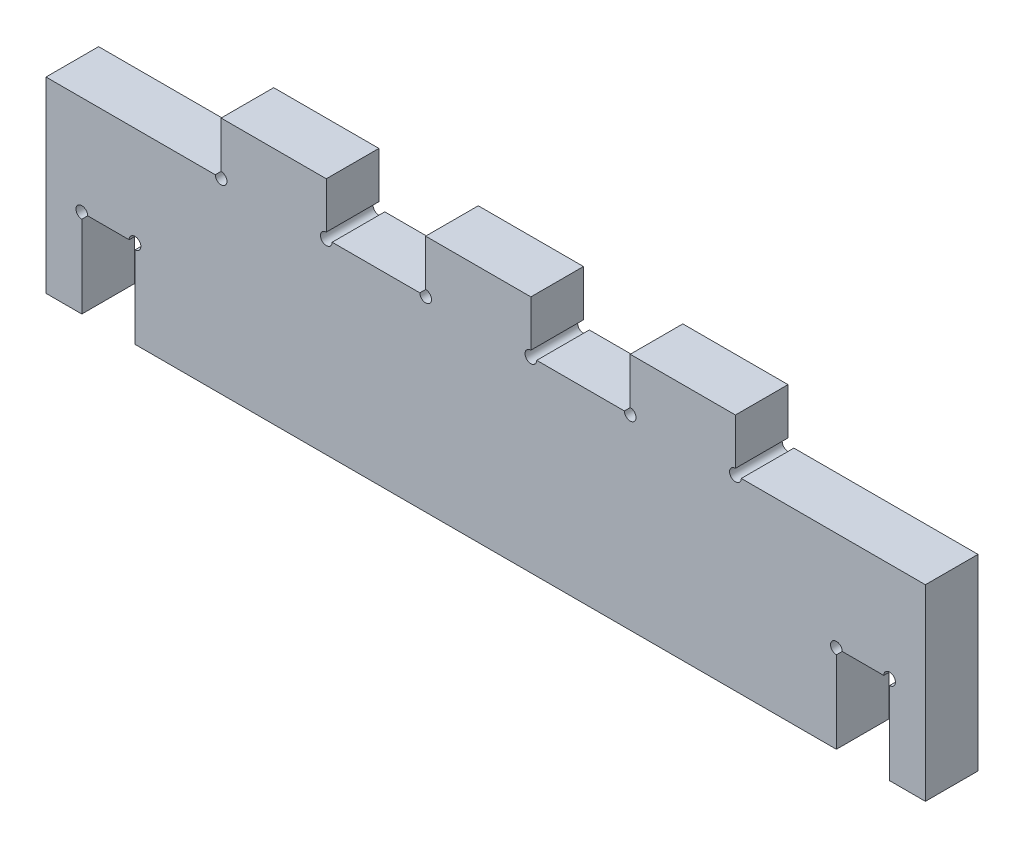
from build123d import *

# Parameters (mm, degrees)
BOSS_EXTRUDE1_DEPTH = 18
SKETCH6_W           = 36
SKETCH6_H           = 18
BOSS_EXTRUDE2_DEPTH = 17.8
LPATTERN1_COUNT     = 3
LPATTERN1_PITCH     = 70
CUT_EXTRUDE1_REACH  = 290.44
SKETCH7_R           = 2


with BuildPart() as part:
    # Sketch5 → Boss-Extrude1 (new body)
    with BuildSketch(Plane.XY.offset(-6.992110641)):
        Polygon((18.6, 17.720771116), (18.6, 47.919144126), (0.4, 47.919144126), (0.4, 17.919144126), (-239.6, 17.919144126), (-239.6, 47.919144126), (-257.8, 47.919144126), (-257.8, 17.801626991), (-270.055127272, 17.801626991), (-270.055127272, 81.919144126), (30.855127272, 81.919144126), (30.855127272, 17.720771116), align=None)
    extrude(amount=BOSS_EXTRUDE1_DEPTH)

    # Sketch6 → Boss-Extrude2 (add)
    with BuildSketch(Plane(origin=(0, 81.919144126, 0), x_dir=(1, 0, 0), z_dir=(0, 1, 0))):
        with Locations((-52.144872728, -2.007889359)):
            Rectangle(SKETCH6_W, SKETCH6_H)
    boss_extrude2 = extrude(amount=BOSS_EXTRUDE2_DEPTH)

    # LPattern1: Boss-Extrude2 ×3
    with Locations(*[(-i * LPATTERN1_PITCH, 0, 0) for i in range(1, LPATTERN1_COUNT)]):
        add(boss_extrude2)

    # Sketch7 → Cut-Extrude1 (cut, up to next)
    with BuildSketch(Plane.XY.offset(11.007889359), mode=Mode.PRIVATE) as cut_extrude1_sk1:
        with Locations((-34.144872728, 81.919144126)):
            Circle(SKETCH7_R)
    cut_extrude1_tool1 = extrude(cut_extrude1_sk1.sketch, amount=-CUT_EXTRUDE1_REACH, mode=Mode.PRIVATE) & part.part
    # Sketch7 → Cut-Extrude1 (cut, up to next)
    with BuildSketch(Plane.XY.offset(11.007889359), mode=Mode.PRIVATE) as cut_extrude1_sk2:
        with Locations((-70.144872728, 81.919144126)):
            Circle(SKETCH7_R)
    cut_extrude1_tool2 = extrude(cut_extrude1_sk2.sketch, amount=-CUT_EXTRUDE1_REACH, mode=Mode.PRIVATE) & part.part
    # Sketch7 → Cut-Extrude1 (cut, up to next)
    with BuildSketch(Plane.XY.offset(11.007889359), mode=Mode.PRIVATE) as cut_extrude1_sk3:
        with Locations((-104.144872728, 81.919144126)):
            Circle(SKETCH7_R)
    cut_extrude1_tool3 = extrude(cut_extrude1_sk3.sketch, amount=-CUT_EXTRUDE1_REACH, mode=Mode.PRIVATE) & part.part
    # Sketch7 → Cut-Extrude1 (cut, up to next)
    with BuildSketch(Plane.XY.offset(11.007889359), mode=Mode.PRIVATE) as cut_extrude1_sk4:
        with Locations((-140.144872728, 81.919144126)):
            Circle(SKETCH7_R)
    cut_extrude1_tool4 = extrude(cut_extrude1_sk4.sketch, amount=-CUT_EXTRUDE1_REACH, mode=Mode.PRIVATE) & part.part
    # Sketch7 → Cut-Extrude1 (cut, up to next)
    with BuildSketch(Plane.XY.offset(11.007889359), mode=Mode.PRIVATE) as cut_extrude1_sk5:
        with Locations((-174.144872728, 81.919144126)):
            Circle(SKETCH7_R)
    cut_extrude1_tool5 = extrude(cut_extrude1_sk5.sketch, amount=-CUT_EXTRUDE1_REACH, mode=Mode.PRIVATE) & part.part
    # Sketch7 → Cut-Extrude1 (cut, up to next)
    with BuildSketch(Plane.XY.offset(11.007889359), mode=Mode.PRIVATE) as cut_extrude1_sk6:
        with Locations((-210.144872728, 81.919144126)):
            Circle(SKETCH7_R)
    cut_extrude1_tool6 = extrude(cut_extrude1_sk6.sketch, amount=-CUT_EXTRUDE1_REACH, mode=Mode.PRIVATE) & part.part
    # Sketch7 → Cut-Extrude1 (cut, up to next)
    with BuildSketch(Plane.XY.offset(11.007889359), mode=Mode.PRIVATE) as cut_extrude1_sk7:
        with Locations((-239.6, 47.919144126)):
            Circle(SKETCH7_R)
    cut_extrude1_tool7 = extrude(cut_extrude1_sk7.sketch, amount=-CUT_EXTRUDE1_REACH, mode=Mode.PRIVATE) & part.part
    # Sketch7 → Cut-Extrude1 (cut, up to next)
    with BuildSketch(Plane.XY.offset(11.007889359), mode=Mode.PRIVATE) as cut_extrude1_sk8:
        with Locations((-257.8, 47.919144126)):
            Circle(SKETCH7_R)
    cut_extrude1_tool8 = extrude(cut_extrude1_sk8.sketch, amount=-CUT_EXTRUDE1_REACH, mode=Mode.PRIVATE) & part.part
    # Sketch7 → Cut-Extrude1 (cut, up to next)
    with BuildSketch(Plane.XY.offset(11.007889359), mode=Mode.PRIVATE) as cut_extrude1_sk9:
        with Locations((18.6, 47.919144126)):
            Circle(SKETCH7_R)
    cut_extrude1_tool9 = extrude(cut_extrude1_sk9.sketch, amount=-CUT_EXTRUDE1_REACH, mode=Mode.PRIVATE) & part.part
    # Sketch7 → Cut-Extrude1 (cut, up to next)
    with BuildSketch(Plane.XY.offset(11.007889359), mode=Mode.PRIVATE) as cut_extrude1_sk10:
        with Locations((0.4, 47.919144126)):
            Circle(SKETCH7_R)
    cut_extrude1_tool10 = extrude(cut_extrude1_sk10.sketch, amount=-CUT_EXTRUDE1_REACH, mode=Mode.PRIVATE) & part.part
    add(cut_extrude1_tool1.solids().sort_by_distance((-34.144873, 81.919144, 11.007889))[0], mode=Mode.SUBTRACT)
    add(cut_extrude1_tool2.solids().sort_by_distance((-70.144873, 81.919144, 11.007889))[0], mode=Mode.SUBTRACT)
    add(cut_extrude1_tool3.solids().sort_by_distance((-104.144873, 81.919144, 11.007889))[0], mode=Mode.SUBTRACT)
    add(cut_extrude1_tool4.solids().sort_by_distance((-140.144873, 81.919144, 11.007889))[0], mode=Mode.SUBTRACT)
    add(cut_extrude1_tool5.solids().sort_by_distance((-174.144873, 81.919144, 11.007889))[0], mode=Mode.SUBTRACT)
    add(cut_extrude1_tool6.solids().sort_by_distance((-210.144873, 81.919144, 11.007889))[0], mode=Mode.SUBTRACT)
    add(cut_extrude1_tool7.solids().sort_by_distance((-239.6, 47.919144, 11.007889))[0], mode=Mode.SUBTRACT)
    add(cut_extrude1_tool8.solids().sort_by_distance((-257.8, 47.919144, 11.007889))[0], mode=Mode.SUBTRACT)
    add(cut_extrude1_tool9.solids().sort_by_distance((18.6, 47.919144, 11.007889))[0], mode=Mode.SUBTRACT)
    add(cut_extrude1_tool10.solids().sort_by_distance((0.4, 47.919144, 11.007889))[0], mode=Mode.SUBTRACT)


solid = part.part
